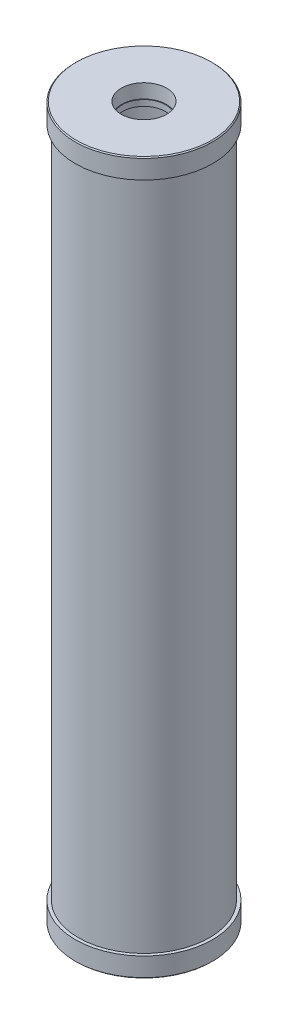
ISO-10303-21;
HEADER;
FILE_DESCRIPTION(('STEP AP214'),'2;1');
FILE_NAME('part.step','',(''),(''),'','','');
FILE_SCHEMA(('AUTOMOTIVE_DESIGN { 1 0 10303 214 1 1 1 1 }'));
ENDSEC;
DATA;
#1=APPLICATION_CONTEXT('core data for automotive mechanical design processes');
#2=APPLICATION_PROTOCOL_DEFINITION('international standard','automotive_design',2000,#1);
#3=PRODUCT_CONTEXT('',#1,'mechanical');
#4=PRODUCT('Part','Part','',(#3));
#5=PRODUCT_RELATED_PRODUCT_CATEGORY('part','',(#4));
#6=PRODUCT_DEFINITION_FORMATION('','',#4);
#7=PRODUCT_DEFINITION_CONTEXT('part definition',#1,'design');
#8=PRODUCT_DEFINITION('design','',#6,#7);
#9=PRODUCT_DEFINITION_SHAPE('','',#8);
#10=(LENGTH_UNIT() NAMED_UNIT(*) SI_UNIT(.MILLI.,.METRE.));
#11=(NAMED_UNIT(*) PLANE_ANGLE_UNIT() SI_UNIT($,.RADIAN.));
#12=(NAMED_UNIT(*) SI_UNIT($,.STERADIAN.) SOLID_ANGLE_UNIT());
#13=UNCERTAINTY_MEASURE_WITH_UNIT(LENGTH_MEASURE(1.E-05),#10,'distance_accuracy_value','');
#14=(GEOMETRIC_REPRESENTATION_CONTEXT(3) GLOBAL_UNCERTAINTY_ASSIGNED_CONTEXT((#13)) GLOBAL_UNIT_ASSIGNED_CONTEXT((#10,
#11,#12)) REPRESENTATION_CONTEXT('',''));
#15=CARTESIAN_POINT('',(0.,0.,0.));
#16=DIRECTION('',(0.,0.,1.));
#17=DIRECTION('',(1.,0.,0.));
#18=AXIS2_PLACEMENT_3D('',#15,#16,#17);
#19=CARTESIAN_POINT('',(0.,25.4,0.));
#20=DIRECTION('',(0.,1.,0.));
#21=DIRECTION('',(0.,0.,1.));
#22=AXIS2_PLACEMENT_3D('',#19,#20,#21);
#23=PLANE('',#22);
#24=CARTESIAN_POINT('',(0.,25.4,0.));
#25=DIRECTION('',(0.,1.,0.));
#26=DIRECTION('',(0.,0.,1.));
#27=AXIS2_PLACEMENT_3D('',#24,#25,#26);
#28=CIRCLE('',#27,27.7876);
#29=CARTESIAN_POINT('',(0.,25.4,27.7876));
#30=VERTEX_POINT('',#29);
#31=EDGE_CURVE('E53',#30,#30,#28,.T.);
#32=ORIENTED_EDGE('',*,*,#31,.F.);
#33=EDGE_LOOP('',(#32));
#34=FACE_BOUND('',#33,.T.);
#35=CARTESIAN_POINT('',(0.,25.4,0.));
#36=DIRECTION('',(0.,1.,0.));
#37=DIRECTION('',(0.,0.,1.));
#38=AXIS2_PLACEMENT_3D('',#35,#36,#37);
#39=CIRCLE('',#38,74.676);
#40=CARTESIAN_POINT('',(0.,25.4,74.676));
#41=VERTEX_POINT('',#40);
#42=EDGE_CURVE('E67',#41,#41,#39,.T.);
#43=ORIENTED_EDGE('',*,*,#42,.T.);
#44=EDGE_LOOP('',(#43));
#45=FACE_BOUND('',#44,.T.);
#46=ADVANCED_FACE('F32',(#34,#45),#23,.T.);
#47=CARTESIAN_POINT('',(0.,914.4,0.));
#48=DIRECTION('',(0.,-1.,0.));
#49=DIRECTION('',(0.,0.,-1.));
#50=AXIS2_PLACEMENT_3D('',#47,#48,#49);
#51=CYLINDRICAL_SURFACE('',#50,74.676);
#52=ORIENTED_EDGE('',*,*,#42,.F.);
#53=EDGE_LOOP('',(#52));
#54=FACE_BOUND('',#53,.T.);
#55=CARTESIAN_POINT('',(0.,889.,0.));
#56=DIRECTION('',(0.,1.,0.));
#57=DIRECTION('',(0.,0.,1.));
#58=AXIS2_PLACEMENT_3D('',#55,#56,#57);
#59=CIRCLE('',#58,74.676);
#60=CARTESIAN_POINT('',(0.,889.,74.676));
#61=VERTEX_POINT('',#60);
#62=EDGE_CURVE('E63',#61,#61,#59,.T.);
#63=ORIENTED_EDGE('',*,*,#62,.T.);
#64=EDGE_LOOP('',(#63));
#65=FACE_BOUND('',#64,.T.);
#66=ADVANCED_FACE('F117',(#54,#65),#51,.F.);
#67=CARTESIAN_POINT('',(0.,889.,0.));
#68=DIRECTION('',(0.,1.,0.));
#69=DIRECTION('',(0.,0.,1.));
#70=AXIS2_PLACEMENT_3D('',#67,#68,#69);
#71=PLANE('',#70);
#72=CARTESIAN_POINT('',(0.,889.,0.));
#73=DIRECTION('',(0.,1.,0.));
#74=DIRECTION('',(0.,0.,1.));
#75=AXIS2_PLACEMENT_3D('',#72,#73,#74);
#76=CIRCLE('',#75,27.7876);
#77=CARTESIAN_POINT('',(0.,889.,27.7876));
#78=VERTEX_POINT('',#77);
#79=EDGE_CURVE('E58',#78,#78,#76,.T.);
#80=ORIENTED_EDGE('',*,*,#79,.T.);
#81=EDGE_LOOP('',(#80));
#82=FACE_BOUND('',#81,.T.);
#83=ORIENTED_EDGE('',*,*,#62,.F.);
#84=EDGE_LOOP('',(#83));
#85=FACE_BOUND('',#84,.T.);
#86=ADVANCED_FACE('F110',(#82,#85),#71,.F.);
#87=CARTESIAN_POINT('',(0.,914.4,0.));
#88=DIRECTION('',(0.,1.,0.));
#89=DIRECTION('',(0.,0.,1.));
#90=AXIS2_PLACEMENT_3D('',#87,#88,#89);
#91=CYLINDRICAL_SURFACE('',#90,27.7876);
#92=CARTESIAN_POINT('',(0.,896.62,0.));
#93=DIRECTION('',(0.,1.,0.));
#94=DIRECTION('',(0.,0.,1.));
#95=AXIS2_PLACEMENT_3D('',#92,#93,#94);
#96=CIRCLE('',#95,27.7876);
#97=CARTESIAN_POINT('',(0.,896.62,27.7876));
#98=VERTEX_POINT('',#97);
#99=EDGE_CURVE('E62',#98,#98,#96,.T.);
#100=ORIENTED_EDGE('',*,*,#99,.T.);
#101=EDGE_LOOP('',(#100));
#102=FACE_BOUND('',#101,.T.);
#103=ORIENTED_EDGE('',*,*,#79,.F.);
#104=EDGE_LOOP('',(#103));
#105=FACE_BOUND('',#104,.T.);
#106=ADVANCED_FACE('F177',(#102,#105),#91,.F.);
#107=CARTESIAN_POINT('',(27.7876,896.62,0.));
#108=DIRECTION('',(0.,-1.,0.));
#109=DIRECTION('',(0.,0.,-1.));
#110=AXIS2_PLACEMENT_3D('',#107,#108,#109);
#111=PLANE('',#110);
#112=ORIENTED_EDGE('',*,*,#99,.F.);
#113=EDGE_LOOP('',(#112));
#114=FACE_BOUND('',#113,.T.);
#115=CARTESIAN_POINT('',(0.,896.62,0.));
#116=DIRECTION('',(0.,1.,0.));
#117=DIRECTION('',(0.,0.,1.));
#118=AXIS2_PLACEMENT_3D('',#115,#116,#117);
#119=CIRCLE('',#118,28.6326341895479);
#120=CARTESIAN_POINT('',(0.,896.62,28.6326341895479));
#121=VERTEX_POINT('',#120);
#122=EDGE_CURVE('E81',#121,#121,#119,.T.);
#123=ORIENTED_EDGE('',*,*,#122,.T.);
#124=EDGE_LOOP('',(#123));
#125=FACE_BOUND('',#124,.T.);
#126=ADVANCED_FACE('F146',(#114,#125),#111,.F.);
#127=CARTESIAN_POINT('',(0.,914.4,0.));
#128=DIRECTION('',(0.,1.,0.));
#129=DIRECTION('',(0.,0.,1.));
#130=AXIS2_PLACEMENT_3D('',#127,#128,#129);
#131=CONICAL_SURFACE('',#130,29.1649912,0.0299323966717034);
#132=ORIENTED_EDGE('',*,*,#122,.F.);
#133=EDGE_LOOP('',(#132));
#134=FACE_BOUND('',#133,.T.);
#135=CARTESIAN_POINT('',(0.,914.4,0.));
#136=DIRECTION('',(0.,1.,0.));
#137=DIRECTION('',(0.,0.,1.));
#138=AXIS2_PLACEMENT_3D('',#135,#136,#137);
#139=CIRCLE('',#138,29.1649912);
#140=CARTESIAN_POINT('',(0.,914.4,29.1649912));
#141=VERTEX_POINT('',#140);
#142=EDGE_CURVE('E56',#141,#141,#139,.T.);
#143=ORIENTED_EDGE('',*,*,#142,.T.);
#144=EDGE_LOOP('',(#143));
#145=FACE_BOUND('',#144,.T.);
#146=ADVANCED_FACE('F134',(#134,#145),#131,.F.);
#147=CARTESIAN_POINT('',(0.,914.4,0.));
#148=DIRECTION('',(0.,-1.,0.));
#149=DIRECTION('',(0.,0.,-1.));
#150=AXIS2_PLACEMENT_3D('',#147,#148,#149);
#151=CYLINDRICAL_SURFACE('',#150,84.201);
#152=CARTESIAN_POINT('',(0.,25.4,0.));
#153=DIRECTION('',(0.,1.,0.));
#154=DIRECTION('',(0.,0.,1.));
#155=AXIS2_PLACEMENT_3D('',#152,#153,#154);
#156=CIRCLE('',#155,84.201);
#157=CARTESIAN_POINT('',(0.,25.4,84.201));
#158=VERTEX_POINT('',#157);
#159=EDGE_CURVE('E70',#158,#158,#156,.T.);
#160=ORIENTED_EDGE('',*,*,#159,.T.);
#161=EDGE_LOOP('',(#160));
#162=FACE_BOUND('',#161,.T.);
#163=CARTESIAN_POINT('',(0.,889.,0.));
#164=DIRECTION('',(0.,1.,0.));
#165=DIRECTION('',(0.,0.,1.));
#166=AXIS2_PLACEMENT_3D('',#163,#164,#165);
#167=CIRCLE('',#166,84.201);
#168=CARTESIAN_POINT('',(0.,889.,84.201));
#169=VERTEX_POINT('',#168);
#170=EDGE_CURVE('E52',#169,#169,#167,.T.);
#171=ORIENTED_EDGE('',*,*,#170,.F.);
#172=EDGE_LOOP('',(#171));
#173=FACE_BOUND('',#172,.T.);
#174=ADVANCED_FACE('F129',(#162,#173),#151,.T.);
#175=CARTESIAN_POINT('',(0.,25.4,0.));
#176=DIRECTION('',(0.,1.,0.));
#177=DIRECTION('',(0.,0.,1.));
#178=AXIS2_PLACEMENT_3D('',#175,#176,#177);
#179=CIRCLE('',#178,88.265);
#180=CARTESIAN_POINT('',(0.,25.4,88.265));
#181=VERTEX_POINT('',#180);
#182=EDGE_CURVE('E66',#181,#181,#179,.T.);
#183=ORIENTED_EDGE('',*,*,#182,.T.);
#184=EDGE_LOOP('',(#183));
#185=FACE_BOUND('',#184,.T.);
#186=ORIENTED_EDGE('',*,*,#159,.F.);
#187=EDGE_LOOP('',(#186));
#188=FACE_BOUND('',#187,.T.);
#189=ADVANCED_FACE('F111',(#185,#188),#23,.T.);
#190=CARTESIAN_POINT('',(0.,25.4,0.));
#191=DIRECTION('',(0.,-1.,0.));
#192=DIRECTION('',(0.,0.,-1.));
#193=AXIS2_PLACEMENT_3D('',#190,#191,#192);
#194=CYLINDRICAL_SURFACE('',#193,88.265);
#195=CARTESIAN_POINT('',(0.,1.26999999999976,0.));
#196=DIRECTION('',(0.,1.,0.));
#197=DIRECTION('',(0.,0.,1.));
#198=AXIS2_PLACEMENT_3D('',#195,#196,#197);
#199=CIRCLE('',#198,88.265);
#200=CARTESIAN_POINT('',(0.,1.26999999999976,88.265));
#201=VERTEX_POINT('',#200);
#202=EDGE_CURVE('E47',#201,#201,#199,.T.);
#203=ORIENTED_EDGE('',*,*,#202,.T.);
#204=EDGE_LOOP('',(#203));
#205=FACE_BOUND('',#204,.T.);
#206=ORIENTED_EDGE('',*,*,#182,.F.);
#207=EDGE_LOOP('',(#206));
#208=FACE_BOUND('',#207,.T.);
#209=ADVANCED_FACE('F100',(#205,#208),#194,.T.);
#210=CARTESIAN_POINT('',(0.,0.,0.));
#211=DIRECTION('',(0.,1.,0.));
#212=DIRECTION('',(0.,0.,1.));
#213=AXIS2_PLACEMENT_3D('',#210,#211,#212);
#214=PLANE('',#213);
#215=CARTESIAN_POINT('',(0.,0.,0.));
#216=DIRECTION('',(0.,1.,0.));
#217=DIRECTION('',(0.,0.,1.));
#218=AXIS2_PLACEMENT_3D('',#215,#216,#217);
#219=CIRCLE('',#218,86.9950000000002);
#220=CARTESIAN_POINT('',(0.,0.,86.9950000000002));
#221=VERTEX_POINT('',#220);
#222=EDGE_CURVE('E43',#221,#221,#219,.F.);
#223=ORIENTED_EDGE('',*,*,#222,.T.);
#224=EDGE_LOOP('',(#223));
#225=FACE_BOUND('',#224,.T.);
#226=CARTESIAN_POINT('',(0.,0.,0.));
#227=DIRECTION('',(0.,-1.,0.));
#228=DIRECTION('',(0.,0.,-1.));
#229=AXIS2_PLACEMENT_3D('',#226,#227,#228);
#230=CIRCLE('',#229,29.1649912);
#231=CARTESIAN_POINT('',(0.,0.,-29.1649912));
#232=VERTEX_POINT('',#231);
#233=EDGE_CURVE('E91',#232,#232,#230,.T.);
#234=ORIENTED_EDGE('',*,*,#233,.F.);
#235=EDGE_LOOP('',(#234));
#236=FACE_BOUND('',#235,.T.);
#237=ADVANCED_FACE('F97',(#225,#236),#214,.F.);
#238=CARTESIAN_POINT('',(0.,889.,0.));
#239=DIRECTION('',(0.,1.,0.));
#240=DIRECTION('',(0.,0.,1.));
#241=AXIS2_PLACEMENT_3D('',#238,#239,#240);
#242=CIRCLE('',#241,88.265);
#243=CARTESIAN_POINT('',(0.,889.,88.265));
#244=VERTEX_POINT('',#243);
#245=EDGE_CURVE('E61',#244,#244,#242,.T.);
#246=ORIENTED_EDGE('',*,*,#245,.F.);
#247=EDGE_LOOP('',(#246));
#248=FACE_BOUND('',#247,.T.);
#249=ORIENTED_EDGE('',*,*,#170,.T.);
#250=EDGE_LOOP('',(#249));
#251=FACE_BOUND('',#250,.T.);
#252=ADVANCED_FACE('F99',(#248,#251),#71,.F.);
#253=CARTESIAN_POINT('',(0.,889.,0.));
#254=DIRECTION('',(0.,1.,0.));
#255=DIRECTION('',(0.,0.,1.));
#256=AXIS2_PLACEMENT_3D('',#253,#254,#255);
#257=CYLINDRICAL_SURFACE('',#256,88.265);
#258=CARTESIAN_POINT('',(0.,913.13,0.));
#259=DIRECTION('',(0.,1.,0.));
#260=DIRECTION('',(0.,0.,1.));
#261=AXIS2_PLACEMENT_3D('',#258,#259,#260);
#262=CIRCLE('',#261,88.265);
#263=CARTESIAN_POINT('',(0.,913.13,-88.2650000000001));
#264=VERTEX_POINT('',#263);
#265=EDGE_CURVE('E10',#264,#264,#262,.F.);
#266=ORIENTED_EDGE('',*,*,#265,.T.);
#267=EDGE_LOOP('',(#266));
#268=FACE_BOUND('',#267,.T.);
#269=ORIENTED_EDGE('',*,*,#245,.T.);
#270=EDGE_LOOP('',(#269));
#271=FACE_BOUND('',#270,.T.);
#272=ADVANCED_FACE('F107',(#268,#271),#257,.T.);
#273=CARTESIAN_POINT('',(0.,914.4,0.));
#274=DIRECTION('',(0.,1.,0.));
#275=DIRECTION('',(0.,0.,1.));
#276=AXIS2_PLACEMENT_3D('',#273,#274,#275);
#277=PLANE('',#276);
#278=CARTESIAN_POINT('',(0.,914.4,0.));
#279=DIRECTION('',(0.,1.,0.));
#280=DIRECTION('',(0.,0.,1.));
#281=AXIS2_PLACEMENT_3D('',#278,#279,#280);
#282=CIRCLE('',#281,86.9950000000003);
#283=CARTESIAN_POINT('',(0.,914.4,-86.9950000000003));
#284=VERTEX_POINT('',#283);
#285=EDGE_CURVE('E39',#284,#284,#282,.T.);
#286=ORIENTED_EDGE('',*,*,#285,.T.);
#287=EDGE_LOOP('',(#286));
#288=FACE_BOUND('',#287,.T.);
#289=ORIENTED_EDGE('',*,*,#142,.F.);
#290=EDGE_LOOP('',(#289));
#291=FACE_BOUND('',#290,.T.);
#292=ADVANCED_FACE('F172',(#288,#291),#277,.T.);
#293=CARTESIAN_POINT('',(0.,0.,0.));
#294=DIRECTION('',(0.,-1.,0.));
#295=DIRECTION('',(0.,0.,-1.));
#296=AXIS2_PLACEMENT_3D('',#293,#294,#295);
#297=CYLINDRICAL_SURFACE('',#296,27.7876);
#298=ORIENTED_EDGE('',*,*,#31,.T.);
#299=EDGE_LOOP('',(#298));
#300=FACE_BOUND('',#299,.T.);
#301=CARTESIAN_POINT('',(0.,17.78,0.));
#302=DIRECTION('',(0.,-1.,0.));
#303=DIRECTION('',(0.,0.,-1.));
#304=AXIS2_PLACEMENT_3D('',#301,#302,#303);
#305=CIRCLE('',#304,27.7876);
#306=CARTESIAN_POINT('',(0.,17.78,-27.7876));
#307=VERTEX_POINT('',#306);
#308=EDGE_CURVE('E57',#307,#307,#305,.T.);
#309=ORIENTED_EDGE('',*,*,#308,.T.);
#310=EDGE_LOOP('',(#309));
#311=FACE_BOUND('',#310,.T.);
#312=ADVANCED_FACE('F166',(#300,#311),#297,.F.);
#313=CARTESIAN_POINT('',(27.7876,17.78,0.));
#314=DIRECTION('',(0.,1.,0.));
#315=DIRECTION('',(0.,0.,1.));
#316=AXIS2_PLACEMENT_3D('',#313,#314,#315);
#317=PLANE('',#316);
#318=ORIENTED_EDGE('',*,*,#308,.F.);
#319=EDGE_LOOP('',(#318));
#320=FACE_BOUND('',#319,.T.);
#321=CARTESIAN_POINT('',(0.,17.78,0.));
#322=DIRECTION('',(0.,-1.,0.));
#323=DIRECTION('',(0.,0.,-1.));
#324=AXIS2_PLACEMENT_3D('',#321,#322,#323);
#325=CIRCLE('',#324,28.6326341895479);
#326=CARTESIAN_POINT('',(0.,17.78,-28.6326341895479));
#327=VERTEX_POINT('',#326);
#328=EDGE_CURVE('E88',#327,#327,#325,.T.);
#329=ORIENTED_EDGE('',*,*,#328,.T.);
#330=EDGE_LOOP('',(#329));
#331=FACE_BOUND('',#330,.T.);
#332=ADVANCED_FACE('F157',(#320,#331),#317,.F.);
#333=CARTESIAN_POINT('',(0.,0.,0.));
#334=DIRECTION('',(0.,-1.,0.));
#335=DIRECTION('',(0.,0.,-1.));
#336=AXIS2_PLACEMENT_3D('',#333,#334,#335);
#337=CONICAL_SURFACE('',#336,29.1649912,0.0299323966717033);
#338=ORIENTED_EDGE('',*,*,#328,.F.);
#339=EDGE_LOOP('',(#338));
#340=FACE_BOUND('',#339,.T.);
#341=ORIENTED_EDGE('',*,*,#233,.T.);
#342=EDGE_LOOP('',(#341));
#343=FACE_BOUND('',#342,.T.);
#344=ADVANCED_FACE('F95',(#340,#343),#337,.F.);
#345=CARTESIAN_POINT('',(0.,1.26999999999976,0.));
#346=DIRECTION('',(0.,1.,0.));
#347=DIRECTION('',(0.,0.,1.));
#348=AXIS2_PLACEMENT_3D('',#345,#346,#347);
#349=CONICAL_SURFACE('',#348,88.265,0.785398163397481);
#350=ORIENTED_EDGE('',*,*,#222,.F.);
#351=EDGE_LOOP('',(#350));
#352=FACE_BOUND('',#351,.T.);
#353=ORIENTED_EDGE('',*,*,#202,.F.);
#354=EDGE_LOOP('',(#353));
#355=FACE_BOUND('',#354,.T.);
#356=ADVANCED_FACE('F149',(#352,#355),#349,.T.);
#357=CARTESIAN_POINT('',(0.,914.4,0.));
#358=DIRECTION('',(0.,-1.,0.));
#359=DIRECTION('',(0.,0.,-1.));
#360=AXIS2_PLACEMENT_3D('',#357,#358,#359);
#361=CONICAL_SURFACE('',#360,86.9950000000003,0.785398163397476);
#362=CARTESIAN_POINT('',(0.,913.13,-88.2650000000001));
#363=CARTESIAN_POINT('',(0.,913.143229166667,-88.2517708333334));
#364=CARTESIAN_POINT('',(0.,913.156458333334,-88.2385416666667));
#365=CARTESIAN_POINT('',(0.,913.182916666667,-88.2120833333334));
#366=CARTESIAN_POINT('',(0.,913.196145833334,-88.1988541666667));
#367=CARTESIAN_POINT('',(0.,913.222604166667,-88.1723958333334));
#368=CARTESIAN_POINT('',(0.,913.235833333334,-88.1591666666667));
#369=CARTESIAN_POINT('',(0.,913.262291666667,-88.1327083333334));
#370=CARTESIAN_POINT('',(0.,913.275520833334,-88.1194791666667));
#371=CARTESIAN_POINT('',(0.,913.301979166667,-88.0930208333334));
#372=CARTESIAN_POINT('',(0.,913.315208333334,-88.0797916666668));
#373=CARTESIAN_POINT('',(0.,913.341666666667,-88.0533333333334));
#374=CARTESIAN_POINT('',(0.,913.354895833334,-88.0401041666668));
#375=CARTESIAN_POINT('',(0.,913.381354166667,-88.0136458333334));
#376=CARTESIAN_POINT('',(0.,913.394583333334,-88.0004166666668));
#377=CARTESIAN_POINT('',(0.,913.421041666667,-87.9739583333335));
#378=CARTESIAN_POINT('',(0.,913.434270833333,-87.9607291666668));
#379=CARTESIAN_POINT('',(0.,913.460729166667,-87.9342708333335));
#380=CARTESIAN_POINT('',(0.,913.473958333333,-87.9210416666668));
#381=CARTESIAN_POINT('',(0.,913.500416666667,-87.8945833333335));
#382=CARTESIAN_POINT('',(0.,913.513645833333,-87.8813541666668));
#383=CARTESIAN_POINT('',(0.,913.540104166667,-87.8548958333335));
#384=CARTESIAN_POINT('',(0.,913.553333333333,-87.8416666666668));
#385=CARTESIAN_POINT('',(0.,913.579791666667,-87.8152083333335));
#386=CARTESIAN_POINT('',(0.,913.593020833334,-87.8019791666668));
#387=CARTESIAN_POINT('',(0.,913.619479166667,-87.7755208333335));
#388=CARTESIAN_POINT('',(0.,913.632708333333,-87.7622916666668));
#389=CARTESIAN_POINT('',(0.,913.659166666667,-87.7358333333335));
#390=CARTESIAN_POINT('',(0.,913.672395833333,-87.7226041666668));
#391=CARTESIAN_POINT('',(0.,913.698854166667,-87.6961458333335));
#392=CARTESIAN_POINT('',(0.,913.712083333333,-87.6829166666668));
#393=CARTESIAN_POINT('',(0.,913.738541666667,-87.6564583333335));
#394=CARTESIAN_POINT('',(0.,913.751770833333,-87.6432291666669));
#395=CARTESIAN_POINT('',(0.,913.778229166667,-87.6167708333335));
#396=CARTESIAN_POINT('',(0.,913.791458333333,-87.6035416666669));
#397=CARTESIAN_POINT('',(0.,913.817916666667,-87.5770833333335));
#398=CARTESIAN_POINT('',(0.,913.831145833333,-87.5638541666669));
#399=CARTESIAN_POINT('',(0.,913.857604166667,-87.5373958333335));
#400=CARTESIAN_POINT('',(0.,913.870833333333,-87.5241666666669));
#401=CARTESIAN_POINT('',(0.,913.897291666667,-87.4977083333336));
#402=CARTESIAN_POINT('',(0.,913.910520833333,-87.4844791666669));
#403=CARTESIAN_POINT('',(0.,913.936979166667,-87.4580208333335));
#404=CARTESIAN_POINT('',(0.,913.950208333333,-87.4447916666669));
#405=CARTESIAN_POINT('',(0.,913.976666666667,-87.4183333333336));
#406=CARTESIAN_POINT('',(0.,913.989895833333,-87.4051041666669));
#407=CARTESIAN_POINT('',(0.,914.016354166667,-87.3786458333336));
#408=CARTESIAN_POINT('',(0.,914.029583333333,-87.3654166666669));
#409=CARTESIAN_POINT('',(0.,914.056041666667,-87.3389583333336));
#410=CARTESIAN_POINT('',(0.,914.069270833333,-87.3257291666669));
#411=CARTESIAN_POINT('',(0.,914.095729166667,-87.2992708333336));
#412=CARTESIAN_POINT('',(0.,914.108958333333,-87.2860416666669));
#413=CARTESIAN_POINT('',(0.,914.135416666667,-87.2595833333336));
#414=CARTESIAN_POINT('',(0.,914.148645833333,-87.2463541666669));
#415=CARTESIAN_POINT('',(0.,914.175104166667,-87.2198958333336));
#416=CARTESIAN_POINT('',(0.,914.188333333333,-87.2066666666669));
#417=CARTESIAN_POINT('',(0.,914.214791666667,-87.1802083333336));
#418=CARTESIAN_POINT('',(0.,914.228020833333,-87.166979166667));
#419=CARTESIAN_POINT('',(0.,914.254479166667,-87.1405208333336));
#420=CARTESIAN_POINT('',(0.,914.267708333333,-87.1272916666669));
#421=CARTESIAN_POINT('',(0.,914.294166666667,-87.1008333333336));
#422=CARTESIAN_POINT('',(0.,914.307395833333,-87.087604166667));
#423=CARTESIAN_POINT('',(0.,914.333854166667,-87.0611458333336));
#424=CARTESIAN_POINT('',(0.,914.347083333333,-87.047916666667));
#425=CARTESIAN_POINT('',(0.,914.373541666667,-87.0214583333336));
#426=CARTESIAN_POINT('',(0.,914.386770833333,-87.008229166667));
#427=CARTESIAN_POINT('',(0.,914.4,-86.9950000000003));
#428=B_SPLINE_CURVE_WITH_KNOTS('',3,(#362,#363,#364,#365,#366,#367,#368,#369,#370,#371,#372,
#373,#374,#375,#376,#377,#378,#379,#380,#381,#382,#383,#384,#385,#386,#387,#388,#389,#390,#391,
#392,#393,#394,#395,#396,#397,#398,#399,#400,#401,#402,#403,#404,#405,#406,#407,#408,#409,#410,
#411,#412,#413,#414,#415,#416,#417,#418,#419,#420,#421,#422,#423,#424,#425,#426,#427),
.UNSPECIFIED.,.F.,.F.,(4,2,2,2,2,2,2,2,2,2,2,2,2,2,2,2,2,2,2,2,2,2,2,2,2,2,2,2,2,2,2,2,4),(0.,
0.0561266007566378,0.112253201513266,0.168379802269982,0.22450640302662,0.280633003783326,
0.336759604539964,0.39288620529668,0.449012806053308,0.505139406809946,0.561266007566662,
0.61739260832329,0.673519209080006,0.729645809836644,0.785772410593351,0.841899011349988,
0.898025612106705,0.954152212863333,1.01027881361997,1.06640541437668,1.12253201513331,
1.17865861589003,1.23478521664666,1.29091181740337,1.34703841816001,1.40316501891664,
1.45929161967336,1.51541822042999,1.5715448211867,1.62767142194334,1.68379802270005,
1.73992462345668,1.7960512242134),.UNSPECIFIED.);
#429=EDGE_CURVE('BSEAM34',#264,#284,#428,.T.);
#430=ORIENTED_EDGE('',*,*,#265,.F.);
#431=ORIENTED_EDGE('',*,*,#285,.F.);
#432=ORIENTED_EDGE('',*,*,#429,.T.);
#433=ORIENTED_EDGE('',*,*,#429,.F.);
#434=EDGE_LOOP('',(#430,#432,#431,#433));
#435=FACE_BOUND('',#434,.T.);
#436=ADVANCED_FACE('F34',(#435),#361,.T.);
#437=CLOSED_SHELL('',(#46,#66,#86,#106,#126,#146,#174,#189,#209,#237,#252,#272,#292,#312,#332,
#344,#356,#436));
#438=MANIFOLD_SOLID_BREP('B2',#437);
#439=ADVANCED_BREP_SHAPE_REPRESENTATION('',(#18,#438),#14);
#440=SHAPE_DEFINITION_REPRESENTATION(#9,#439);
ENDSEC;
END-ISO-10303-21;
